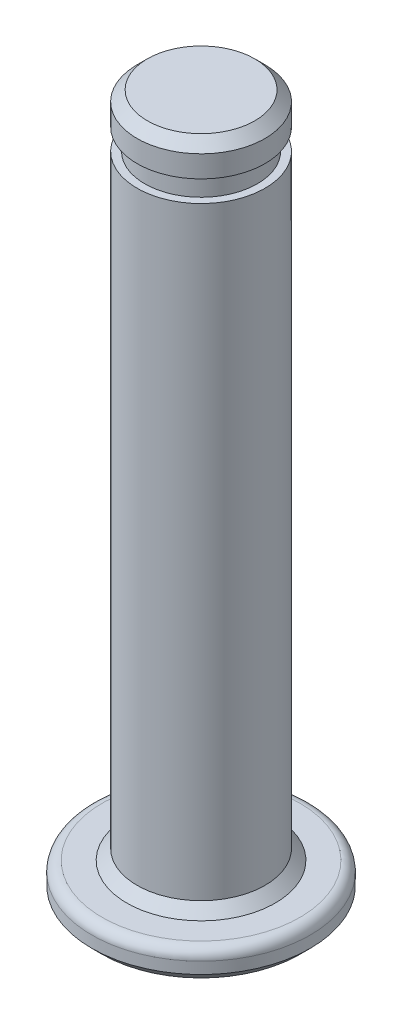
from build123d import *

# Parameters (mm, degrees)
CHAMFER1_SIZE = 0.762
CHAMFER2_SIZE = 0.762
CHAMFER3_SIZE = 0.762
FILLET1_R     = 0.762


with BuildPart() as part:
    # Sketch1 one side → Revolve2 (revolve)
    with BuildSketch(Plane.XY, mode=Mode.PRIVATE) as revolve2_sk:
        Polygon((0, 37.278189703), (0, 89.348189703), (-4.7625, 89.348189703), (-4.7625, 86.966939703), (-4.191, 86.966939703), (-4.191, 85.379439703), (-4.7625, 85.379439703), (-4.7625, 39.659439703), (-8.128, 39.659439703), (-8.128, 37.278189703), align=None)
    revolve(revolve2_sk.sketch.rotate(Axis((0, 0, 0), (0, 1, 0)), 270), axis=Axis((0, 0, 0), (0, 1, 0)))

    # Chamfer1
    chamfer1_edges = [part.edges().sort_by_distance(p)[0] for p in [
        (0, 89.348189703, 4.7625),
    ]]
    chamfer(chamfer1_edges, length=CHAMFER1_SIZE)

    # Chamfer2
    chamfer2_edges = [part.edges().sort_by_distance(p)[0] for p in [
        (0, 39.659439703, 4.7625),
    ]]
    chamfer(chamfer2_edges, length=CHAMFER2_SIZE)

    # Chamfer3
    chamfer3_edges = [part.edges().sort_by_distance(p)[0] for p in [
        (0, 37.278189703, 8.128),
    ]]
    chamfer(chamfer3_edges, length=CHAMFER3_SIZE)

    # Fillet1
    fillet1_edges = [part.edges().sort_by_distance(p)[0] for p in [
        (0, 39.659439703, 8.128),
    ]]
    fillet(fillet1_edges, radius=FILLET1_R)


solid = part.part
